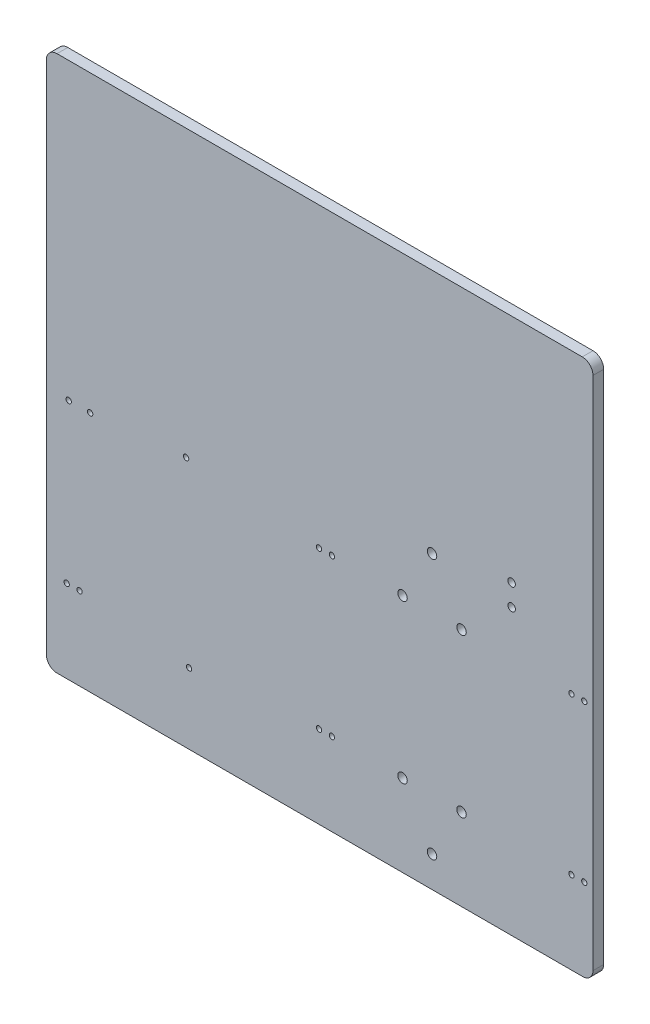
from build123d import *

# Parameters (mm, degrees)
SKETCH1_R           = 2.4765
SKETCH1_R_2         = 2.4892
SKETCH1_R_3         = 4.40055
SKETCH1_R_4         = 3.5
BOSS_EXTRUDE1_DEPTH = 10
FILLET1_R           = 10


with BuildPart() as part:
    # Sketch1 → Boss-Extrude1 (new body)
    with BuildSketch(Plane.XY):
        with BuildLine():
            ThreePointArc((41.275, 0), (48.010192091, 2.789807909), (50.8, 9.525))
            Line((50.8, 9.525), (50.8, 500))
            Line((50.8, 500), (-458.725, 500))
            Line((-458.725, 500), (-458.725, 0))
            Line((-458.725, 0), (41.275, 0))
        make_face()
        with Locations((42.7125, 76.999999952)):
            Circle(SKETCH1_R, mode=Mode.SUBTRACT)
        with Locations((42.7125, 223.000000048)):
            Circle(SKETCH1_R_2, mode=Mode.SUBTRACT)
        with Locations((-99.2, 271.25)):
            Circle(SKETCH1_R_3, mode=Mode.SUBTRACT)
        with Locations((-25.00000001, 265)):
            Circle(SKETCH1_R_4, mode=Mode.SUBTRACT)
        with Locations((-25.00000001, 285)):
            Circle(SKETCH1_R_4, mode=Mode.SUBTRACT)
        with Locations((-439.725, 76.999999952)):
            Circle(SKETCH1_R_2, mode=Mode.SUBTRACT)
        with Locations((-427.725, 76.999999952)):
            Circle(SKETCH1_R, mode=Mode.SUBTRACT)
        with Locations((-325.652282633, 65.799999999)):
            Circle(SKETCH1_R_2, mode=Mode.SUBTRACT)
        with Locations((-204.50625, 76.999999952)):
            Circle(SKETCH1_R_2, mode=Mode.SUBTRACT)
        with Locations((-437.868823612, 225.5)):
            Circle(SKETCH1_R_2, mode=Mode.SUBTRACT)
        with Locations((-417.868823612, 225.5)):
            Circle(SKETCH1_R_2, mode=Mode.SUBTRACT)
        with Locations((-328.426497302, 234.199999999)):
            Circle(SKETCH1_R_2, mode=Mode.SUBTRACT)
        with Locations((-204.50625, 223.000000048)):
            Circle(SKETCH1_R, mode=Mode.SUBTRACT)
        with Locations((-99.2, 28.75)):
            Circle(SKETCH1_R_3, mode=Mode.SUBTRACT)
        with Locations((-192.50625, 76.999999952)):
            Circle(SKETCH1_R, mode=Mode.SUBTRACT)
        with Locations((-126.69630657, 76.375)):
            Circle(SKETCH1_R_3, mode=Mode.SUBTRACT)
        with Locations((-71.70369343, 76.375)):
            Circle(SKETCH1_R_3, mode=Mode.SUBTRACT)
        with Locations((30.7125, 76.999999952)):
            Circle(SKETCH1_R_2, mode=Mode.SUBTRACT)
        with Locations((-192.50625, 223.000000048)):
            Circle(SKETCH1_R_2, mode=Mode.SUBTRACT)
        with Locations((-126.69630657, 223.625)):
            Circle(SKETCH1_R_3, mode=Mode.SUBTRACT)
        with Locations((-71.70369343, 223.625)):
            Circle(SKETCH1_R_3, mode=Mode.SUBTRACT)
        with Locations((30.7125, 223.000000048)):
            Circle(SKETCH1_R, mode=Mode.SUBTRACT)
    extrude(amount=BOSS_EXTRUDE1_DEPTH)

    # Fillet1
    fillet1_edges = [part.edges().sort_by_distance(p)[0] for p in [
        (-458.725, 0, 5),
        (-458.725, 500, 5),
        (50.8, 500, 5),
    ]]
    fillet(fillet1_edges, radius=FILLET1_R)


solid = part.part
